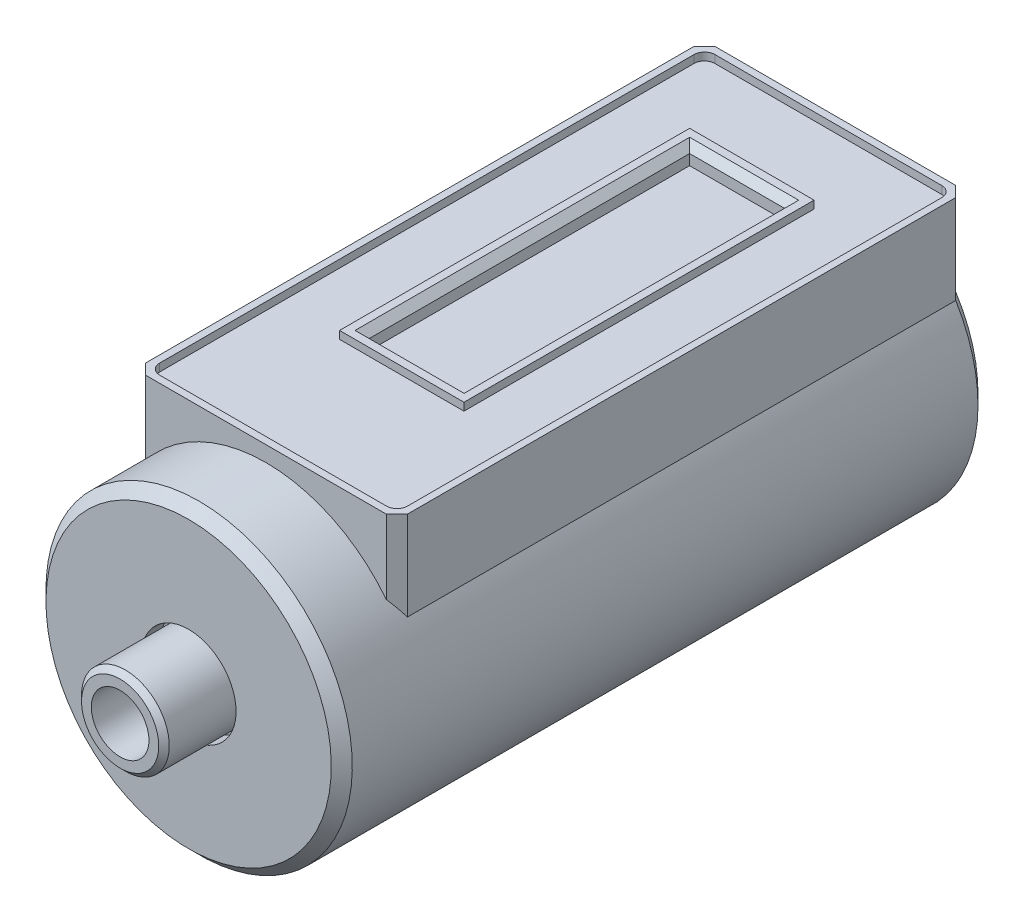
from build123d import *

# Parameters (mm, degrees)
EXTRUDE1_DEPTH     = 12.19
CHAMFER1_SIZE      = 0.76
SKETCH4_W          = 8.99
SKETCH4_H          = 25.3
CUT_EXTRUDE1_DEPTH = 0.56
SKETCH5_W          = 6.86
SKETCH5_H          = 23.16
CUT_EXTRUDE2_DEPTH = 1.27
CHAMFER2_SIZE      = 0.51
HOLE1_D            = 4.1656
HOLE1_DEPTH        = 6.35
HOLE1_TIP          = 1.251472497


with BuildPart() as part:
    # Sketch2 → Revolve1 (revolve)
    with BuildSketch(Plane(origin=(0, 0, 0), x_dir=(0, 0, -1), z_dir=(1, 0, 0))):
        Polygon((4.31, 0), (4.31, 2.79), (4.69, 3.17), (10.53, 3.17), (10.53, 3.43), (9.26, 3.43), (9.26, 10.31), (10.02, 11.07), (56, 11.07), (56, 0), align=None)
    revolve(axis=Axis((0, 0, -56), (0, 0, 1)))

    # Sketch3 → Extrude1 (add)
    with BuildSketch(Plane(origin=(0, 0, 0), x_dir=(1, 0, 0), z_dir=(0, 1, 0))):
        Polygon((-9.46, 56), (9.46, 56), (9.46, 15.61), (8.7, 14.85), (-8.7, 14.85), (-9.46, 15.61), align=None)
    extrude(amount=EXTRUDE1_DEPTH)

    # Chamfer1
    chamfer1_edges = [part.edges().sort_by_distance(p)[0] for p in [
        (-9.46, 8.969599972, -56),
        (9.46, 8.969599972, -56),
        (0, -11.07, -56),
    ]]
    chamfer(chamfer1_edges, length=CHAMFER1_SIZE)

    # Sketch4 → Cut-Extrude1 (cut)
    with BuildSketch(Plane(origin=(0, 12.19, 0), x_dir=(1, 0, 0), z_dir=(0, 1, 0))):
        with BuildLine():
            Line((-8.19, 55.49), (8.2, 55.49))
            ThreePointArc((8.2, 55.49), (8.737401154, 55.267401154), (8.96, 54.73))
            Line((8.96, 54.73), (8.96, 16.12))
            ThreePointArc((8.96, 16.12), (8.737401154, 15.582598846), (8.2, 15.36))
            Line((8.2, 15.36), (-8.19, 15.36))
            ThreePointArc((-8.19, 15.36), (-8.727401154, 15.582598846), (-8.95, 16.12))
            Line((-8.95, 16.12), (-8.95, 54.73))
            ThreePointArc((-8.95, 54.73), (-8.727401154, 55.267401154), (-8.19, 55.49))
        make_face()
        with Locations((0.005, 37.31)):
            Rectangle(SKETCH4_W, SKETCH4_H, mode=Mode.SUBTRACT)
    extrude(amount=-CUT_EXTRUDE1_DEPTH, mode=Mode.SUBTRACT)

    # Sketch5 → Cut-Extrude2 (cut)
    with BuildSketch(Plane(origin=(0, 12.19, 0), x_dir=(1, 0, 0), z_dir=(0, 1, 0))):
        with Locations((0.01, 37.31)):
            Rectangle(SKETCH5_W, SKETCH5_H)
    extrude(amount=-CUT_EXTRUDE2_DEPTH, mode=Mode.SUBTRACT)

    # Chamfer2
    chamfer2_edges = [part.edges().sort_by_distance(p)[0] for p in [
        (-3.42, 12.19, -37.31),
        (0.01, 12.19, -25.73),
        (3.44, 12.19, -37.31),
        (0.01, 12.19, -48.89),
    ]]
    chamfer(chamfer2_edges, length=CHAMFER2_SIZE)

    # Hole1
    with Locations(Plane.XY.offset(-4.31)):
        with Locations((0, 0)):
            Hole(HOLE1_D / 2, depth=HOLE1_DEPTH)
            with Locations((0, 0, -(HOLE1_DEPTH + HOLE1_TIP / 2))):  # 118° drill point
                Cone(0, HOLE1_D / 2, HOLE1_TIP, mode=Mode.SUBTRACT)


solid = part.part
